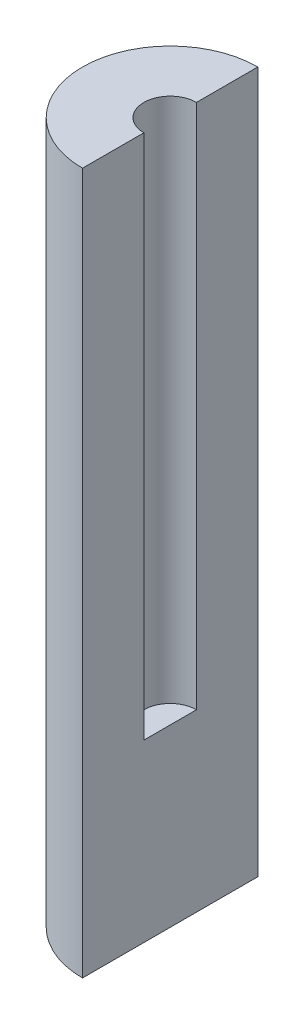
from build123d import *

# Parameters (mm, degrees)
SKETCH1_R          = 25
EXTRUDE1_DEPTH     = 200
SKETCH2_R          = 7.5
CUT_EXTRUDE1_DEPTH = 150
SKETCH3_W          = 25
SKETCH3_H          = 50
CUT_EXTRUDE2_DEPTH = 204.100960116


with BuildPart() as part:
    # Sketch1 → Extrude1 (new body)
    with BuildSketch(Plane(origin=(0, 0, 0), x_dir=(1, 0, 0), z_dir=(0, 1, 0))):
        with Locations(Location((0, 0, 0), (0, 0, 270))):
            Circle(SKETCH1_R)
    extrude(amount=EXTRUDE1_DEPTH)

    # Sketch2 → Cut-Extrude1 (cut)
    with BuildSketch(Plane(origin=(0, 200, 0), x_dir=(-1, 0, 0), z_dir=(0, 1, 0))):
        with Locations(Location((0, 0, 0), (0, 0, 90))):
            Circle(SKETCH2_R)
    extrude(amount=-CUT_EXTRUDE1_DEPTH, mode=Mode.SUBTRACT)

    # Sketch3 → Cut-Extrude2 (cut, through all)
    with BuildSketch(Plane(origin=(0, 200, 0), x_dir=(-1, 0, 0), z_dir=(0, 1, 0))):
        with Locations((-12.5, 0)):
            Rectangle(SKETCH3_W, SKETCH3_H)
    extrude(amount=-CUT_EXTRUDE2_DEPTH, mode=Mode.SUBTRACT)


solid = part.part
